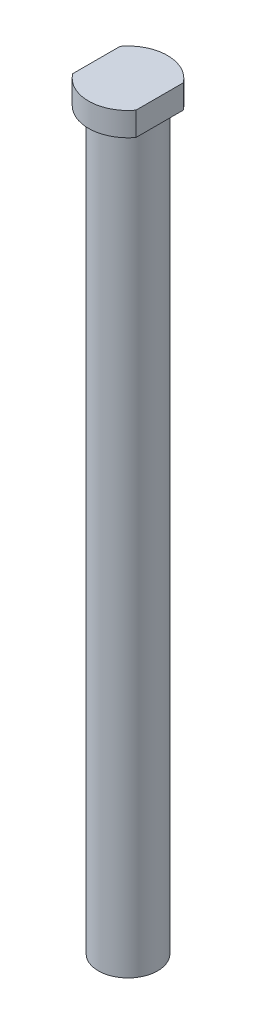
ISO-10303-21;
HEADER;
FILE_DESCRIPTION(('STEP AP214'),'2;1');
FILE_NAME('part.step','',(''),(''),'','','');
FILE_SCHEMA(('AUTOMOTIVE_DESIGN { 1 0 10303 214 1 1 1 1 }'));
ENDSEC;
DATA;
#1=APPLICATION_CONTEXT('core data for automotive mechanical design processes');
#2=APPLICATION_PROTOCOL_DEFINITION('international standard','automotive_design',2000,#1);
#3=PRODUCT_CONTEXT('',#1,'mechanical');
#4=PRODUCT('Part','Part','',(#3));
#5=PRODUCT_RELATED_PRODUCT_CATEGORY('part','',(#4));
#6=PRODUCT_DEFINITION_FORMATION('','',#4);
#7=PRODUCT_DEFINITION_CONTEXT('part definition',#1,'design');
#8=PRODUCT_DEFINITION('design','',#6,#7);
#9=PRODUCT_DEFINITION_SHAPE('','',#8);
#10=(LENGTH_UNIT() NAMED_UNIT(*) SI_UNIT(.MILLI.,.METRE.));
#11=(NAMED_UNIT(*) PLANE_ANGLE_UNIT() SI_UNIT($,.RADIAN.));
#12=(NAMED_UNIT(*) SI_UNIT($,.STERADIAN.) SOLID_ANGLE_UNIT());
#13=UNCERTAINTY_MEASURE_WITH_UNIT(LENGTH_MEASURE(1.E-05),#10,'distance_accuracy_value','');
#14=(GEOMETRIC_REPRESENTATION_CONTEXT(3) GLOBAL_UNCERTAINTY_ASSIGNED_CONTEXT((#13)) GLOBAL_UNIT_ASSIGNED_CONTEXT((#10,
#11,#12)) REPRESENTATION_CONTEXT('',''));
#15=CARTESIAN_POINT('',(0.,0.,0.));
#16=DIRECTION('',(0.,0.,1.));
#17=DIRECTION('',(1.,0.,0.));
#18=AXIS2_PLACEMENT_3D('',#15,#16,#17);
#19=CARTESIAN_POINT('',(0.,-176.99999999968,0.));
#20=DIRECTION('',(0.,-1.,0.));
#21=DIRECTION('',(0.,0.,-1.));
#22=AXIS2_PLACEMENT_3D('',#19,#20,#21);
#23=CONICAL_SURFACE('',#22,3.32349999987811,1.04719755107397);
#24=CARTESIAN_POINT('',(0.,-177.,0.));
#25=DIRECTION('',(0.,1.,0.));
#26=DIRECTION('',(0.,0.,1.));
#27=AXIS2_PLACEMENT_3D('',#24,#25,#26);
#28=CIRCLE('',#27,3.3235);
#29=CARTESIAN_POINT('',(0.,-177.,3.3235));
#30=VERTEX_POINT('',#29);
#31=EDGE_CURVE('E124',#30,#30,#28,.F.);
#32=ORIENTED_EDGE('',*,*,#31,.T.);
#33=EDGE_LOOP('',(#32));
#34=FACE_BOUND('',#33,.T.);
#35=CARTESIAN_POINT('',(8.5265128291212E-11,-175.08117637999,-2.8421709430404E-11));
#36=VERTEX_POINT('',#35);
#37=VERTEX_LOOP('',#36);
#38=FACE_BOUND('',#37,.T.);
#39=ADVANCED_FACE('F16',(#34,#38),#23,.F.);
#40=CARTESIAN_POINT('',(0.,-191.9,0.));
#41=DIRECTION('',(0.,1.,0.));
#42=DIRECTION('',(0.,0.,1.));
#43=AXIS2_PLACEMENT_3D('',#40,#41,#42);
#44=CYLINDRICAL_SURFACE('',#43,3.3235);
#45=CARTESIAN_POINT('',(0.,-190.999999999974,0.));
#46=DIRECTION('',(0.,-1.,0.));
#47=DIRECTION('',(0.877582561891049,0.,-0.479425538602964));
#48=AXIS2_PLACEMENT_3D('',#45,#46,#47);
#49=CIRCLE('',#48,3.32350000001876);
#50=CARTESIAN_POINT('',(2.91664564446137,-190.999999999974,-1.59337077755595));
#51=VERTEX_POINT('',#50);
#52=EDGE_CURVE('E121',#51,#51,#49,.T.);
#53=ORIENTED_EDGE('',*,*,#52,.T.);
#54=EDGE_LOOP('',(#53));
#55=FACE_BOUND('',#54,.T.);
#56=ORIENTED_EDGE('',*,*,#31,.F.);
#57=EDGE_LOOP('',(#56));
#58=FACE_BOUND('',#57,.T.);
#59=ADVANCED_FACE('F60',(#55,#58),#44,.F.);
#60=CARTESIAN_POINT('',(0.,0.,0.));
#61=DIRECTION('',(0.,-1.,0.));
#62=DIRECTION('',(0.,0.,-1.));
#63=AXIS2_PLACEMENT_3D('',#60,#61,#62);
#64=PLANE('',#63);
#65=CARTESIAN_POINT('',(0.,0.,0.));
#66=DIRECTION('',(0.,-1.,0.));
#67=DIRECTION('',(0.,0.,-1.));
#68=AXIS2_PLACEMENT_3D('',#65,#66,#67);
#69=CIRCLE('',#68,10.);
#70=CARTESIAN_POINT('',(7.99999999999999,0.,6.00000000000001));
#71=VERTEX_POINT('',#70);
#72=CARTESIAN_POINT('',(-7.99999999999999,0.,6.00000000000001));
#73=VERTEX_POINT('',#72);
#74=EDGE_CURVE('E20',#71,#73,#69,.T.);
#75=ORIENTED_EDGE('',*,*,#74,.F.);
#76=DIRECTION('',(0.,0.,-1.));
#77=VECTOR('',#76,1.);
#78=CARTESIAN_POINT('',(7.99999999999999,0.,-11.9386806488));
#79=LINE('',#78,#77);
#80=CARTESIAN_POINT('',(7.99999999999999,0.,-6.00000000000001));
#81=VERTEX_POINT('',#80);
#82=EDGE_CURVE('E103',#81,#71,#79,.F.);
#83=ORIENTED_EDGE('',*,*,#82,.F.);
#84=CARTESIAN_POINT('',(0.,0.,0.));
#85=DIRECTION('',(0.,-1.,0.));
#86=DIRECTION('',(0.,0.,-1.));
#87=AXIS2_PLACEMENT_3D('',#84,#85,#86);
#88=CIRCLE('',#87,10.);
#89=CARTESIAN_POINT('',(-7.99999999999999,0.,-5.99999999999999));
#90=VERTEX_POINT('',#89);
#91=EDGE_CURVE('E104',#90,#81,#88,.T.);
#92=ORIENTED_EDGE('',*,*,#91,.F.);
#93=DIRECTION('',(0.,0.,1.));
#94=VECTOR('',#93,1.);
#95=CARTESIAN_POINT('',(-7.99999999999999,0.,10.8585357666));
#96=LINE('',#95,#94);
#97=EDGE_CURVE('E110',#73,#90,#96,.F.);
#98=ORIENTED_EDGE('',*,*,#97,.F.);
#99=EDGE_LOOP('',(#75,#83,#92,#98));
#100=FACE_BOUND('',#99,.T.);
#101=ADVANCED_FACE('F67',(#100),#64,.F.);
#102=CARTESIAN_POINT('',(0.,-192.000000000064,0.));
#103=DIRECTION('',(0.,-1.,0.));
#104=DIRECTION('',(0.,0.,-1.));
#105=AXIS2_PLACEMENT_3D('',#102,#103,#104);
#106=CONICAL_SURFACE('',#105,4.32350000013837,0.785398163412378);
#107=ORIENTED_EDGE('',*,*,#52,.F.);
#108=EDGE_LOOP('',(#107));
#109=FACE_BOUND('',#108,.T.);
#110=CARTESIAN_POINT('',(0.,-191.999999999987,0.));
#111=DIRECTION('',(0.,-1.,0.));
#112=DIRECTION('',(0.,0.,-1.));
#113=AXIS2_PLACEMENT_3D('',#110,#111,#112);
#114=CIRCLE('',#113,4.32350000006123);
#115=CARTESIAN_POINT('',(0.,-191.999999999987,-4.32350000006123));
#116=VERTEX_POINT('',#115);
#117=EDGE_CURVE('E101',#116,#116,#114,.F.);
#118=ORIENTED_EDGE('',*,*,#117,.F.);
#119=EDGE_LOOP('',(#118));
#120=FACE_BOUND('',#119,.T.);
#121=ADVANCED_FACE('F129',(#109,#120),#106,.F.);
#122=CARTESIAN_POINT('',(0.,-96.,0.));
#123=DIRECTION('',(0.,-1.,0.));
#124=DIRECTION('',(0.,0.,-1.));
#125=AXIS2_PLACEMENT_3D('',#122,#123,#124);
#126=CYLINDRICAL_SURFACE('',#125,10.);
#127=ORIENTED_EDGE('',*,*,#74,.T.);
#128=DIRECTION('',(0.,1.,0.));
#129=VECTOR('',#128,1.);
#130=CARTESIAN_POINT('',(-7.99999999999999,0.,6.00000000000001));
#131=LINE('',#130,#129);
#132=CARTESIAN_POINT('',(-7.99999999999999,-6.00000000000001,6.00000000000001));
#133=VERTEX_POINT('',#132);
#134=EDGE_CURVE('E113',#133,#73,#131,.T.);
#135=ORIENTED_EDGE('',*,*,#134,.F.);
#136=CARTESIAN_POINT('',(0.,-6.00000000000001,0.));
#137=DIRECTION('',(0.,-1.,0.));
#138=DIRECTION('',(0.,0.,-1.));
#139=AXIS2_PLACEMENT_3D('',#136,#137,#138);
#140=CIRCLE('',#139,10.);
#141=CARTESIAN_POINT('',(7.99999999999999,-6.00000000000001,6.00000000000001));
#142=VERTEX_POINT('',#141);
#143=EDGE_CURVE('E96',#142,#133,#140,.T.);
#144=ORIENTED_EDGE('',*,*,#143,.F.);
#145=DIRECTION('',(0.,1.,0.));
#146=VECTOR('',#145,1.);
#147=CARTESIAN_POINT('',(7.99999999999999,0.,5.99999999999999));
#148=LINE('',#147,#146);
#149=EDGE_CURVE('E105',#71,#142,#148,.F.);
#150=ORIENTED_EDGE('',*,*,#149,.F.);
#151=EDGE_LOOP('',(#127,#135,#144,#150));
#152=FACE_BOUND('',#151,.T.);
#153=ADVANCED_FACE('F132',(#152),#126,.T.);
#154=CARTESIAN_POINT('',(-7.99999999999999,0.,10.8585357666));
#155=DIRECTION('',(-1.,0.,0.));
#156=DIRECTION('',(0.,0.,1.));
#157=AXIS2_PLACEMENT_3D('',#154,#155,#156);
#158=PLANE('',#157);
#159=ORIENTED_EDGE('',*,*,#134,.T.);
#160=ORIENTED_EDGE('',*,*,#97,.T.);
#161=DIRECTION('',(0.,-1.,0.));
#162=VECTOR('',#161,1.);
#163=CARTESIAN_POINT('',(-8.00000000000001,-96.,-5.99999999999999));
#164=LINE('',#163,#162);
#165=CARTESIAN_POINT('',(-7.99999999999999,-6.00000000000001,-5.99999999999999));
#166=VERTEX_POINT('',#165);
#167=EDGE_CURVE('E106',#166,#90,#164,.F.);
#168=ORIENTED_EDGE('',*,*,#167,.F.);
#169=DIRECTION('',(0.,0.,-1.));
#170=VECTOR('',#169,1.);
#171=CARTESIAN_POINT('',(-7.99999999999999,-6.00000000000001,9.99999999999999));
#172=LINE('',#171,#170);
#173=EDGE_CURVE('E91',#133,#166,#172,.T.);
#174=ORIENTED_EDGE('',*,*,#173,.F.);
#175=EDGE_LOOP('',(#159,#160,#168,#174));
#176=FACE_BOUND('',#175,.T.);
#177=ADVANCED_FACE('F149',(#176),#158,.T.);
#178=CARTESIAN_POINT('',(0.,-96.,0.));
#179=DIRECTION('',(0.,-1.,0.));
#180=DIRECTION('',(0.,0.,-1.));
#181=AXIS2_PLACEMENT_3D('',#178,#179,#180);
#182=CYLINDRICAL_SURFACE('',#181,10.);
#183=ORIENTED_EDGE('',*,*,#91,.T.);
#184=DIRECTION('',(0.,1.,0.));
#185=VECTOR('',#184,1.);
#186=CARTESIAN_POINT('',(7.99999999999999,0.,-6.00000000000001));
#187=LINE('',#186,#185);
#188=CARTESIAN_POINT('',(7.99999999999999,-6.00000000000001,-6.00000000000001));
#189=VERTEX_POINT('',#188);
#190=EDGE_CURVE('E35',#189,#81,#187,.T.);
#191=ORIENTED_EDGE('',*,*,#190,.F.);
#192=CARTESIAN_POINT('',(0.,-6.00000000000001,0.));
#193=DIRECTION('',(0.,-1.,0.));
#194=DIRECTION('',(0.,0.,-1.));
#195=AXIS2_PLACEMENT_3D('',#192,#193,#194);
#196=CIRCLE('',#195,10.);
#197=EDGE_CURVE('E87',#166,#189,#196,.T.);
#198=ORIENTED_EDGE('',*,*,#197,.F.);
#199=ORIENTED_EDGE('',*,*,#167,.T.);
#200=EDGE_LOOP('',(#183,#191,#198,#199));
#201=FACE_BOUND('',#200,.T.);
#202=ADVANCED_FACE('F143',(#201),#182,.T.);
#203=CARTESIAN_POINT('',(7.99999999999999,0.,-11.9386806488));
#204=DIRECTION('',(1.,0.,0.));
#205=DIRECTION('',(0.,0.,-1.));
#206=AXIS2_PLACEMENT_3D('',#203,#204,#205);
#207=PLANE('',#206);
#208=ORIENTED_EDGE('',*,*,#190,.T.);
#209=ORIENTED_EDGE('',*,*,#82,.T.);
#210=ORIENTED_EDGE('',*,*,#149,.T.);
#211=DIRECTION('',(0.,0.,-1.));
#212=VECTOR('',#211,1.);
#213=CARTESIAN_POINT('',(7.99999999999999,-6.00000000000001,9.99999999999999));
#214=LINE('',#213,#212);
#215=EDGE_CURVE('E89',#189,#142,#214,.F.);
#216=ORIENTED_EDGE('',*,*,#215,.F.);
#217=EDGE_LOOP('',(#208,#209,#210,#216));
#218=FACE_BOUND('',#217,.T.);
#219=ADVANCED_FACE('F138',(#218),#207,.T.);
#220=CARTESIAN_POINT('',(0.,-192.,7.49999999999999));
#221=DIRECTION('',(0.,-1.,0.));
#222=DIRECTION('',(0.,0.,-1.));
#223=AXIS2_PLACEMENT_3D('',#220,#221,#222);
#224=PLANE('',#223);
#225=ORIENTED_EDGE('',*,*,#117,.T.);
#226=EDGE_LOOP('',(#225));
#227=FACE_BOUND('',#226,.T.);
#228=CARTESIAN_POINT('',(0.,-192.,0.));
#229=DIRECTION('',(0.,-1.,0.));
#230=DIRECTION('',(0.,0.,-1.));
#231=AXIS2_PLACEMENT_3D('',#228,#229,#230);
#232=CIRCLE('',#231,7.5);
#233=CARTESIAN_POINT('',(0.,-192.,-7.5));
#234=VERTEX_POINT('',#233);
#235=EDGE_CURVE('E26',#234,#234,#232,.F.);
#236=ORIENTED_EDGE('',*,*,#235,.F.);
#237=EDGE_LOOP('',(#236));
#238=FACE_BOUND('',#237,.T.);
#239=ADVANCED_FACE('F77',(#227,#238),#224,.T.);
#240=CARTESIAN_POINT('',(0.,-6.00000000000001,9.99999999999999));
#241=DIRECTION('',(0.,-1.,0.));
#242=DIRECTION('',(0.,0.,-1.));
#243=AXIS2_PLACEMENT_3D('',#240,#241,#242);
#244=PLANE('',#243);
#245=CARTESIAN_POINT('',(0.,-6.00000000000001,0.));
#246=DIRECTION('',(0.,-1.,0.));
#247=DIRECTION('',(0.,0.,-1.));
#248=AXIS2_PLACEMENT_3D('',#245,#246,#247);
#249=CIRCLE('',#248,7.5);
#250=CARTESIAN_POINT('',(0.,-6.00000000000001,-7.5));
#251=VERTEX_POINT('',#250);
#252=EDGE_CURVE('E11',#251,#251,#249,.T.);
#253=ORIENTED_EDGE('',*,*,#252,.F.);
#254=EDGE_LOOP('',(#253));
#255=FACE_BOUND('',#254,.T.);
#256=ORIENTED_EDGE('',*,*,#197,.T.);
#257=ORIENTED_EDGE('',*,*,#215,.T.);
#258=ORIENTED_EDGE('',*,*,#143,.T.);
#259=ORIENTED_EDGE('',*,*,#173,.T.);
#260=EDGE_LOOP('',(#256,#257,#258,#259));
#261=FACE_BOUND('',#260,.T.);
#262=ADVANCED_FACE('F72',(#255,#261),#244,.T.);
#263=CARTESIAN_POINT('',(0.,-96.,0.));
#264=DIRECTION('',(0.,-1.,0.));
#265=DIRECTION('',(0.,0.,-1.));
#266=AXIS2_PLACEMENT_3D('',#263,#264,#265);
#267=CYLINDRICAL_SURFACE('',#266,7.5);
#268=ORIENTED_EDGE('',*,*,#235,.T.);
#269=EDGE_LOOP('',(#268));
#270=FACE_BOUND('',#269,.T.);
#271=ORIENTED_EDGE('',*,*,#252,.T.);
#272=EDGE_LOOP('',(#271));
#273=FACE_BOUND('',#272,.T.);
#274=ADVANCED_FACE('F18',(#270,#273),#267,.T.);
#275=CLOSED_SHELL('',(#39,#59,#101,#121,#153,#177,#202,#219,#239,#262,#274));
#276=MANIFOLD_SOLID_BREP('B1',#275);
#277=ADVANCED_BREP_SHAPE_REPRESENTATION('',(#18,#276),#14);
#278=SHAPE_DEFINITION_REPRESENTATION(#9,#277);
ENDSEC;
END-ISO-10303-21;
